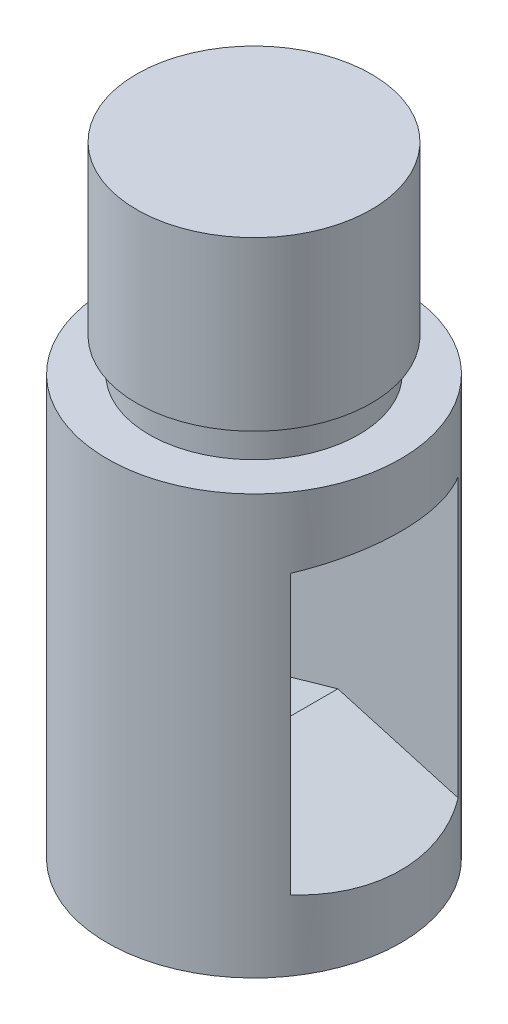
ISO-10303-21;
HEADER;
FILE_DESCRIPTION(('STEP AP214'),'2;1');
FILE_NAME('part.step','',(''),(''),'','','');
FILE_SCHEMA(('AUTOMOTIVE_DESIGN { 1 0 10303 214 1 1 1 1 }'));
ENDSEC;
DATA;
#1=APPLICATION_CONTEXT('core data for automotive mechanical design processes');
#2=APPLICATION_PROTOCOL_DEFINITION('international standard','automotive_design',2000,#1);
#3=PRODUCT_CONTEXT('',#1,'mechanical');
#4=PRODUCT('Part','Part','',(#3));
#5=PRODUCT_RELATED_PRODUCT_CATEGORY('part','',(#4));
#6=PRODUCT_DEFINITION_FORMATION('','',#4);
#7=PRODUCT_DEFINITION_CONTEXT('part definition',#1,'design');
#8=PRODUCT_DEFINITION('design','',#6,#7);
#9=PRODUCT_DEFINITION_SHAPE('','',#8);
#10=(LENGTH_UNIT() NAMED_UNIT(*) SI_UNIT(.MILLI.,.METRE.));
#11=(NAMED_UNIT(*) PLANE_ANGLE_UNIT() SI_UNIT($,.RADIAN.));
#12=(NAMED_UNIT(*) SI_UNIT($,.STERADIAN.) SOLID_ANGLE_UNIT());
#13=UNCERTAINTY_MEASURE_WITH_UNIT(LENGTH_MEASURE(1.E-05),#10,'distance_accuracy_value','');
#14=(GEOMETRIC_REPRESENTATION_CONTEXT(3) GLOBAL_UNCERTAINTY_ASSIGNED_CONTEXT((#13)) GLOBAL_UNIT_ASSIGNED_CONTEXT((#10,
#11,#12)) REPRESENTATION_CONTEXT('',''));
#15=CARTESIAN_POINT('',(0.,0.,0.));
#16=DIRECTION('',(0.,0.,1.));
#17=DIRECTION('',(1.,0.,0.));
#18=AXIS2_PLACEMENT_3D('',#15,#16,#17);
#19=CARTESIAN_POINT('',(0.,-50.,0.));
#20=DIRECTION('',(0.,-1.,0.));
#21=DIRECTION('',(1.,0.,0.));
#22=AXIS2_PLACEMENT_3D('',#19,#20,#21);
#23=PLANE('',#22);
#24=CARTESIAN_POINT('',(0.,-50.,0.));
#25=DIRECTION('',(0.,1.,0.));
#26=DIRECTION('',(-1.,0.,0.));
#27=AXIS2_PLACEMENT_3D('',#24,#25,#26);
#28=CIRCLE('',#27,35.);
#29=CARTESIAN_POINT('',(-35.,-50.,0.));
#30=VERTEX_POINT('',#29);
#31=EDGE_CURVE('E135',#30,#30,#28,.T.);
#32=ORIENTED_EDGE('',*,*,#31,.F.);
#33=EDGE_LOOP('',(#32));
#34=FACE_BOUND('',#33,.T.);
#35=ADVANCED_FACE('F31',(#34),#23,.T.);
#36=CARTESIAN_POINT('',(0.,98.,0.));
#37=DIRECTION('',(0.,1.,0.));
#38=DIRECTION('',(-1.,0.,0.));
#39=AXIS2_PLACEMENT_3D('',#36,#37,#38);
#40=CYLINDRICAL_SURFACE('',#39,35.);
#41=DIRECTION('',(0.,1.,0.));
#42=VECTOR('',#41,1.);
#43=CARTESIAN_POINT('',(-28.7228132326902,98.,-20.));
#44=LINE('',#43,#42);
#45=CARTESIAN_POINT('',(-28.7228132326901,33.2065180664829,-20.));
#46=VERTEX_POINT('',#45);
#47=CARTESIAN_POINT('',(-28.7228132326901,-33.2065180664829,-20.));
#48=VERTEX_POINT('',#47);
#49=EDGE_CURVE('E11',#46,#48,#44,.F.);
#50=ORIENTED_EDGE('',*,*,#49,.F.);
#51=CARTESIAN_POINT('',(0.,25.,0.));
#52=DIRECTION('',(0.274721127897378,0.961523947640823,0.));
#53=DIRECTION('',(-0.961523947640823,0.274721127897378,0.));
#54=AXIS2_PLACEMENT_3D('',#51,#52,#53);
#55=ELLIPSE('',#54,36.4005494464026,35.);
#56=CARTESIAN_POINT('',(-28.7228132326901,33.2065180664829,20.));
#57=VERTEX_POINT('',#56);
#58=EDGE_CURVE('E38',#57,#46,#55,.F.);
#59=ORIENTED_EDGE('',*,*,#58,.F.);
#60=DIRECTION('',(0.,1.,0.));
#61=VECTOR('',#60,1.);
#62=CARTESIAN_POINT('',(-28.7228132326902,98.,20.));
#63=LINE('',#62,#61);
#64=CARTESIAN_POINT('',(-28.7228132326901,-33.2065180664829,20.));
#65=VERTEX_POINT('',#64);
#66=EDGE_CURVE('E145',#57,#65,#63,.F.);
#67=ORIENTED_EDGE('',*,*,#66,.T.);
#68=CARTESIAN_POINT('',(0.,-25.,0.));
#69=DIRECTION('',(0.274721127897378,-0.961523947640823,0.));
#70=DIRECTION('',(0.961523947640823,0.274721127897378,0.));
#71=AXIS2_PLACEMENT_3D('',#68,#69,#70);
#72=ELLIPSE('',#71,36.4005494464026,35.);
#73=EDGE_CURVE('E148',#48,#65,#72,.F.);
#74=ORIENTED_EDGE('',*,*,#73,.F.);
#75=EDGE_LOOP('',(#50,#59,#67,#74));
#76=FACE_BOUND('',#75,.T.);
#77=DIRECTION('',(0.,1.,0.));
#78=VECTOR('',#77,1.);
#79=CARTESIAN_POINT('',(28.7228132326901,98.,-20.));
#80=LINE('',#79,#78);
#81=CARTESIAN_POINT('',(28.7228132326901,-33.2065180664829,-20.));
#82=VERTEX_POINT('',#81);
#83=CARTESIAN_POINT('',(28.7228132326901,33.2065180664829,-20.));
#84=VERTEX_POINT('',#83);
#85=EDGE_CURVE('E143',#82,#84,#80,.T.);
#86=ORIENTED_EDGE('',*,*,#85,.F.);
#87=CARTESIAN_POINT('',(0.,-25.,0.));
#88=DIRECTION('',(-0.274721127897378,-0.961523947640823,0.));
#89=DIRECTION('',(-0.961523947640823,0.274721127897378,0.));
#90=AXIS2_PLACEMENT_3D('',#87,#88,#89);
#91=ELLIPSE('',#90,36.4005494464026,35.);
#92=CARTESIAN_POINT('',(28.7228132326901,-33.2065180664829,20.));
#93=VERTEX_POINT('',#92);
#94=EDGE_CURVE('E105',#93,#82,#91,.F.);
#95=ORIENTED_EDGE('',*,*,#94,.F.);
#96=DIRECTION('',(0.,1.,0.));
#97=VECTOR('',#96,1.);
#98=CARTESIAN_POINT('',(28.7228132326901,98.,20.));
#99=LINE('',#98,#97);
#100=CARTESIAN_POINT('',(28.7228132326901,33.2065180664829,20.));
#101=VERTEX_POINT('',#100);
#102=EDGE_CURVE('E138',#93,#101,#99,.T.);
#103=ORIENTED_EDGE('',*,*,#102,.T.);
#104=CARTESIAN_POINT('',(0.,25.,0.));
#105=DIRECTION('',(-0.274721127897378,0.961523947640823,0.));
#106=DIRECTION('',(0.961523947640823,0.274721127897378,0.));
#107=AXIS2_PLACEMENT_3D('',#104,#105,#106);
#108=ELLIPSE('',#107,36.4005494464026,35.);
#109=EDGE_CURVE('E53',#84,#101,#108,.F.);
#110=ORIENTED_EDGE('',*,*,#109,.F.);
#111=EDGE_LOOP('',(#86,#95,#103,#110));
#112=FACE_BOUND('',#111,.T.);
#113=ORIENTED_EDGE('',*,*,#31,.T.);
#114=EDGE_LOOP('',(#113));
#115=FACE_BOUND('',#114,.T.);
#116=CARTESIAN_POINT('',(0.,50.,0.));
#117=DIRECTION('',(0.,1.,0.));
#118=DIRECTION('',(-1.,0.,0.));
#119=AXIS2_PLACEMENT_3D('',#116,#117,#118);
#120=CIRCLE('',#119,35.);
#121=CARTESIAN_POINT('',(-35.,50.,0.));
#122=VERTEX_POINT('',#121);
#123=EDGE_CURVE('E132',#122,#122,#120,.T.);
#124=ORIENTED_EDGE('',*,*,#123,.F.);
#125=EDGE_LOOP('',(#124));
#126=FACE_BOUND('',#125,.T.);
#127=ADVANCED_FACE('F156',(#76,#112,#115,#126),#40,.T.);
#128=CARTESIAN_POINT('',(-35.,50.,0.));
#129=DIRECTION('',(0.,1.,0.));
#130=DIRECTION('',(-1.,0.,0.));
#131=AXIS2_PLACEMENT_3D('',#128,#129,#130);
#132=PLANE('',#131);
#133=ORIENTED_EDGE('',*,*,#123,.T.);
#134=EDGE_LOOP('',(#133));
#135=FACE_BOUND('',#134,.T.);
#136=CARTESIAN_POINT('',(0.,50.,0.));
#137=DIRECTION('',(0.,1.,0.));
#138=DIRECTION('',(-1.,0.,0.));
#139=AXIS2_PLACEMENT_3D('',#136,#137,#138);
#140=CIRCLE('',#139,25.);
#141=CARTESIAN_POINT('',(-25.,50.,0.));
#142=VERTEX_POINT('',#141);
#143=EDGE_CURVE('E129',#142,#142,#140,.T.);
#144=ORIENTED_EDGE('',*,*,#143,.F.);
#145=EDGE_LOOP('',(#144));
#146=FACE_BOUND('',#145,.T.);
#147=ADVANCED_FACE('F175',(#135,#146),#132,.T.);
#148=CARTESIAN_POINT('',(0.,98.,0.));
#149=DIRECTION('',(0.,1.,0.));
#150=DIRECTION('',(-1.,0.,0.));
#151=AXIS2_PLACEMENT_3D('',#148,#149,#150);
#152=CYLINDRICAL_SURFACE('',#151,25.);
#153=ORIENTED_EDGE('',*,*,#143,.T.);
#154=EDGE_LOOP('',(#153));
#155=FACE_BOUND('',#154,.T.);
#156=CARTESIAN_POINT('',(0.,58.,0.));
#157=DIRECTION('',(0.,1.,0.));
#158=DIRECTION('',(-1.,0.,0.));
#159=AXIS2_PLACEMENT_3D('',#156,#157,#158);
#160=CIRCLE('',#159,25.);
#161=CARTESIAN_POINT('',(-25.,58.,0.));
#162=VERTEX_POINT('',#161);
#163=EDGE_CURVE('E126',#162,#162,#160,.T.);
#164=ORIENTED_EDGE('',*,*,#163,.F.);
#165=EDGE_LOOP('',(#164));
#166=FACE_BOUND('',#165,.T.);
#167=ADVANCED_FACE('F182',(#155,#166),#152,.T.);
#168=CARTESIAN_POINT('',(-25.,58.,0.));
#169=DIRECTION('',(0.,-1.,0.));
#170=DIRECTION('',(1.,0.,0.));
#171=AXIS2_PLACEMENT_3D('',#168,#169,#170);
#172=PLANE('',#171);
#173=ORIENTED_EDGE('',*,*,#163,.T.);
#174=EDGE_LOOP('',(#173));
#175=FACE_BOUND('',#174,.T.);
#176=CARTESIAN_POINT('',(0.,58.,0.));
#177=DIRECTION('',(0.,1.,0.));
#178=DIRECTION('',(-1.,0.,0.));
#179=AXIS2_PLACEMENT_3D('',#176,#177,#178);
#180=CIRCLE('',#179,28.);
#181=CARTESIAN_POINT('',(-28.,58.,0.));
#182=VERTEX_POINT('',#181);
#183=EDGE_CURVE('E123',#182,#182,#180,.T.);
#184=ORIENTED_EDGE('',*,*,#183,.F.);
#185=EDGE_LOOP('',(#184));
#186=FACE_BOUND('',#185,.T.);
#187=ADVANCED_FACE('F188',(#175,#186),#172,.T.);
#188=CARTESIAN_POINT('',(0.,98.,0.));
#189=DIRECTION('',(0.,1.,0.));
#190=DIRECTION('',(-1.,0.,0.));
#191=AXIS2_PLACEMENT_3D('',#188,#189,#190);
#192=CYLINDRICAL_SURFACE('',#191,28.);
#193=ORIENTED_EDGE('',*,*,#183,.T.);
#194=EDGE_LOOP('',(#193));
#195=FACE_BOUND('',#194,.T.);
#196=CARTESIAN_POINT('',(0.,98.,0.));
#197=DIRECTION('',(0.,1.,0.));
#198=DIRECTION('',(-1.,0.,0.));
#199=AXIS2_PLACEMENT_3D('',#196,#197,#198);
#200=CIRCLE('',#199,28.);
#201=CARTESIAN_POINT('',(-28.,98.,0.));
#202=VERTEX_POINT('',#201);
#203=EDGE_CURVE('E119',#202,#202,#200,.T.);
#204=ORIENTED_EDGE('',*,*,#203,.F.);
#205=EDGE_LOOP('',(#204));
#206=FACE_BOUND('',#205,.T.);
#207=ADVANCED_FACE('F194',(#195,#206),#192,.T.);
#208=CARTESIAN_POINT('',(-28.,98.,0.));
#209=DIRECTION('',(0.,1.,0.));
#210=DIRECTION('',(-1.,0.,0.));
#211=AXIS2_PLACEMENT_3D('',#208,#209,#210);
#212=PLANE('',#211);
#213=ORIENTED_EDGE('',*,*,#203,.T.);
#214=EDGE_LOOP('',(#213));
#215=FACE_BOUND('',#214,.T.);
#216=ADVANCED_FACE('F168',(#215),#212,.T.);
#217=CARTESIAN_POINT('',(-35.,35.,-20.));
#218=DIRECTION('',(0.274721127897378,0.961523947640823,0.));
#219=DIRECTION('',(-0.961523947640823,0.274721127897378,0.));
#220=AXIS2_PLACEMENT_3D('',#217,#218,#219);
#221=PLANE('',#220);
#222=ORIENTED_EDGE('',*,*,#58,.T.);
#223=DIRECTION('',(-0.961523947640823,0.274721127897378,0.));
#224=VECTOR('',#223,1.);
#225=CARTESIAN_POINT('',(-35.,35.,-20.));
#226=LINE('',#225,#224);
#227=CARTESIAN_POINT('',(0.,25.,-20.));
#228=VERTEX_POINT('',#227);
#229=EDGE_CURVE('E101',#228,#46,#226,.T.);
#230=ORIENTED_EDGE('',*,*,#229,.F.);
#231=DIRECTION('',(0.,0.,1.));
#232=VECTOR('',#231,1.);
#233=CARTESIAN_POINT('',(0.,25.,-20.));
#234=LINE('',#233,#232);
#235=CARTESIAN_POINT('',(0.,25.,20.));
#236=VERTEX_POINT('',#235);
#237=EDGE_CURVE('E100',#228,#236,#234,.T.);
#238=ORIENTED_EDGE('',*,*,#237,.T.);
#239=DIRECTION('',(-0.961523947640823,0.274721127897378,0.));
#240=VECTOR('',#239,1.);
#241=CARTESIAN_POINT('',(-35.,35.,20.));
#242=LINE('',#241,#240);
#243=EDGE_CURVE('E93',#236,#57,#242,.T.);
#244=ORIENTED_EDGE('',*,*,#243,.T.);
#245=EDGE_LOOP('',(#222,#230,#238,#244));
#246=FACE_BOUND('',#245,.T.);
#247=ADVANCED_FACE('F152',(#246),#221,.F.);
#248=CARTESIAN_POINT('',(0.,25.,-20.));
#249=DIRECTION('',(-0.274721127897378,0.961523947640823,0.));
#250=DIRECTION('',(-0.961523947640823,-0.274721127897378,0.));
#251=AXIS2_PLACEMENT_3D('',#248,#249,#250);
#252=PLANE('',#251);
#253=ORIENTED_EDGE('',*,*,#109,.T.);
#254=DIRECTION('',(-0.961523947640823,-0.274721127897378,0.));
#255=VECTOR('',#254,1.);
#256=CARTESIAN_POINT('',(0.,25.,20.));
#257=LINE('',#256,#255);
#258=EDGE_CURVE('E114',#101,#236,#257,.T.);
#259=ORIENTED_EDGE('',*,*,#258,.T.);
#260=ORIENTED_EDGE('',*,*,#237,.F.);
#261=DIRECTION('',(-0.961523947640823,-0.274721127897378,0.));
#262=VECTOR('',#261,1.);
#263=CARTESIAN_POINT('',(0.,25.,-20.));
#264=LINE('',#263,#262);
#265=EDGE_CURVE('E106',#84,#228,#264,.T.);
#266=ORIENTED_EDGE('',*,*,#265,.F.);
#267=EDGE_LOOP('',(#253,#259,#260,#266));
#268=FACE_BOUND('',#267,.T.);
#269=ADVANCED_FACE('F160',(#268),#252,.F.);
#270=CARTESIAN_POINT('',(35.,-35.,-20.));
#271=DIRECTION('',(-0.274721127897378,-0.961523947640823,0.));
#272=DIRECTION('',(0.961523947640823,-0.274721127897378,0.));
#273=AXIS2_PLACEMENT_3D('',#270,#271,#272);
#274=PLANE('',#273);
#275=ORIENTED_EDGE('',*,*,#94,.T.);
#276=DIRECTION('',(0.961523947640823,-0.274721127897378,0.));
#277=VECTOR('',#276,1.);
#278=CARTESIAN_POINT('',(35.,-35.,-20.));
#279=LINE('',#278,#277);
#280=CARTESIAN_POINT('',(0.,-25.,-20.));
#281=VERTEX_POINT('',#280);
#282=EDGE_CURVE('E88',#281,#82,#279,.T.);
#283=ORIENTED_EDGE('',*,*,#282,.F.);
#284=DIRECTION('',(0.,0.,1.));
#285=VECTOR('',#284,1.);
#286=CARTESIAN_POINT('',(0.,-25.,-20.));
#287=LINE('',#286,#285);
#288=CARTESIAN_POINT('',(0.,-25.,20.));
#289=VERTEX_POINT('',#288);
#290=EDGE_CURVE('E96',#281,#289,#287,.T.);
#291=ORIENTED_EDGE('',*,*,#290,.T.);
#292=DIRECTION('',(0.961523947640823,-0.274721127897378,0.));
#293=VECTOR('',#292,1.);
#294=CARTESIAN_POINT('',(35.,-35.,20.));
#295=LINE('',#294,#293);
#296=EDGE_CURVE('E112',#289,#93,#295,.T.);
#297=ORIENTED_EDGE('',*,*,#296,.T.);
#298=EDGE_LOOP('',(#275,#283,#291,#297));
#299=FACE_BOUND('',#298,.T.);
#300=ADVANCED_FACE('F103',(#299),#274,.F.);
#301=CARTESIAN_POINT('',(0.,-25.,-20.));
#302=DIRECTION('',(0.274721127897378,-0.961523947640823,0.));
#303=DIRECTION('',(0.961523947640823,0.274721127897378,0.));
#304=AXIS2_PLACEMENT_3D('',#301,#302,#303);
#305=PLANE('',#304);
#306=DIRECTION('',(0.961523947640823,0.274721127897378,0.));
#307=VECTOR('',#306,1.);
#308=CARTESIAN_POINT('',(0.,-25.,-20.));
#309=LINE('',#308,#307);
#310=EDGE_CURVE('E84',#48,#281,#309,.T.);
#311=ORIENTED_EDGE('',*,*,#310,.F.);
#312=ORIENTED_EDGE('',*,*,#73,.T.);
#313=DIRECTION('',(0.961523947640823,0.274721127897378,0.));
#314=VECTOR('',#313,1.);
#315=CARTESIAN_POINT('',(0.,-25.,20.));
#316=LINE('',#315,#314);
#317=EDGE_CURVE('E45',#65,#289,#316,.T.);
#318=ORIENTED_EDGE('',*,*,#317,.T.);
#319=ORIENTED_EDGE('',*,*,#290,.F.);
#320=EDGE_LOOP('',(#311,#312,#318,#319));
#321=FACE_BOUND('',#320,.T.);
#322=ADVANCED_FACE('F97',(#321),#305,.F.);
#323=CARTESIAN_POINT('',(-35.,15.,-20.));
#324=DIRECTION('',(0.,0.,-1.));
#325=DIRECTION('',(-1.,0.,0.));
#326=AXIS2_PLACEMENT_3D('',#323,#324,#325);
#327=PLANE('',#326);
#328=ORIENTED_EDGE('',*,*,#49,.T.);
#329=ORIENTED_EDGE('',*,*,#310,.T.);
#330=ORIENTED_EDGE('',*,*,#282,.T.);
#331=ORIENTED_EDGE('',*,*,#85,.T.);
#332=ORIENTED_EDGE('',*,*,#265,.T.);
#333=ORIENTED_EDGE('',*,*,#229,.T.);
#334=EDGE_LOOP('',(#328,#329,#330,#331,#332,#333));
#335=FACE_BOUND('',#334,.T.);
#336=ADVANCED_FACE('F86',(#335),#327,.F.);
#337=CARTESIAN_POINT('',(-35.,15.,20.));
#338=DIRECTION('',(0.,0.,-1.));
#339=DIRECTION('',(-1.,0.,0.));
#340=AXIS2_PLACEMENT_3D('',#337,#338,#339);
#341=PLANE('',#340);
#342=ORIENTED_EDGE('',*,*,#243,.F.);
#343=ORIENTED_EDGE('',*,*,#258,.F.);
#344=ORIENTED_EDGE('',*,*,#102,.F.);
#345=ORIENTED_EDGE('',*,*,#296,.F.);
#346=ORIENTED_EDGE('',*,*,#317,.F.);
#347=ORIENTED_EDGE('',*,*,#66,.F.);
#348=EDGE_LOOP('',(#342,#343,#344,#345,#346,#347));
#349=FACE_BOUND('',#348,.T.);
#350=ADVANCED_FACE('F158',(#349),#341,.T.);
#351=CLOSED_SHELL('',(#35,#127,#147,#167,#187,#207,#216,#247,#269,#300,#322,#336,#350));
#352=MANIFOLD_SOLID_BREP('B2',#351);
#353=ADVANCED_BREP_SHAPE_REPRESENTATION('',(#18,#352),#14);
#354=SHAPE_DEFINITION_REPRESENTATION(#9,#353);
ENDSEC;
END-ISO-10303-21;
